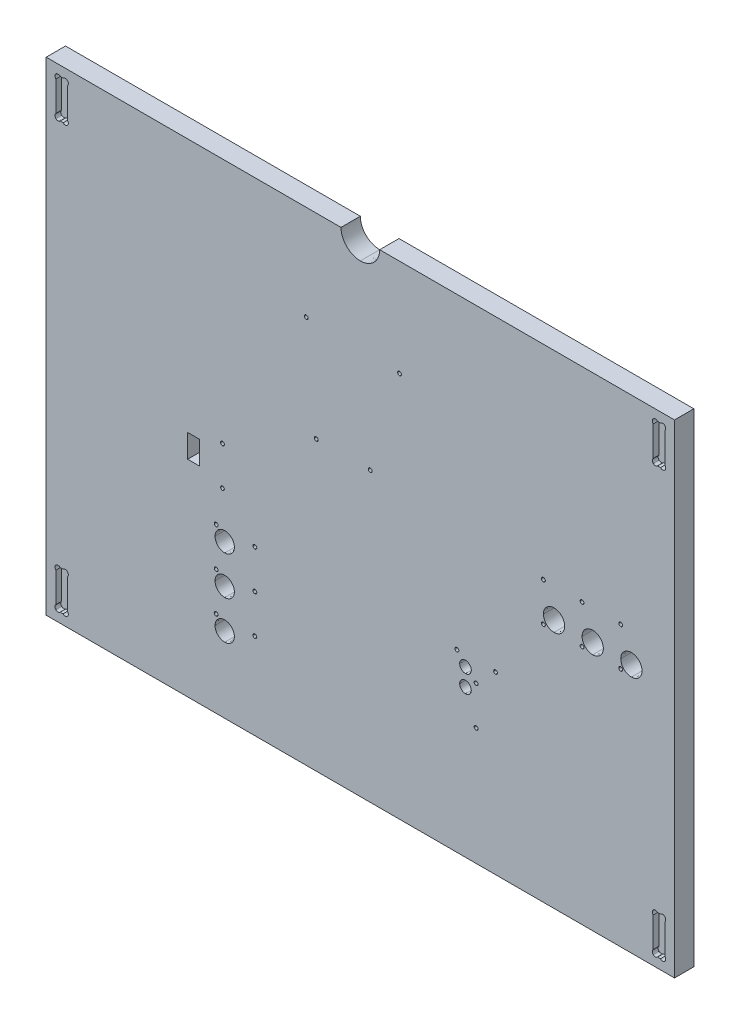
from build123d import *

# Parameters (mm, degrees)
MODEL_W                 = 5.999978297
MODEL_H                 = 12.000128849
BOSS_EXTRU_1_DEPTH      = 10
ENL_V_MAT_EXTRU_1_DEPTH = 3


with BuildPart() as part:
    # Model → Boss.-Extru.1 (new body)
    with BuildSketch(Plane.XY):
        with BuildLine():
            Line((340.358552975, 37.546028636), (187.858989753, 37.546028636))
            add(Edge.make_bspline(
                [(187.858989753, 37.546028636), (187.858989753, 32.023196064), (183.38208817, 27.545949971), (177.859255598, 27.545949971)],
                knots=[1, 1, 1, 1, 2, 2, 2, 2], degree=3))
            add(Edge.make_bspline(
                [(177.859255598, 27.545949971), (172.336423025, 27.545949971), (167.859176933, 32.023196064), (167.859176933, 37.546028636)],
                knots=[2, 2, 2, 2, 3, 3, 3, 3], degree=3))
            Line((167.859176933, 37.546028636), (15.359613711, 37.546028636))
            Line((15.359613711, 37.546028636), (15.359613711, -212.453870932))
            Line((15.359613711, -212.453870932), (340.358552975, -212.453870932))
            Line((340.358552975, -212.453870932), (340.358552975, 37.546028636))
        make_face()
        with Locations((91.548933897, -99.966249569)):
            Rectangle(MODEL_W, MODEL_H, mode=Mode.SUBTRACT)
        with BuildLine():
            add(Edge.make_bspline(
                [(112.704920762, -173.353759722), (112.704920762, -170.592515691), (110.466297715, -168.353892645), (107.704709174, -168.353892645)],
                knots=[0, 0, 0, 0, 1, 1, 1, 1], degree=3))
            add(Edge.make_bspline(
                [(107.704709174, -168.353892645), (104.943465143, -168.353892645), (102.704842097, -170.592515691), (102.704842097, -173.353759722)],
                knots=[1, 1, 1, 1, 2, 2, 2, 2], degree=3))
            add(Edge.make_bspline(
                [(102.704842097, -173.353759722), (102.704842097, -176.115348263), (104.943465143, -178.35397131), (107.704709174, -178.35397131)],
                knots=[2, 2, 2, 2, 3, 3, 3, 3], degree=3))
            add(Edge.make_bspline(
                [(107.704709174, -178.35397131), (110.466297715, -178.35397131), (112.704920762, -176.115348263), (112.704920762, -173.353759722)],
                knots=[3, 3, 3, 3, 4, 4, 4, 4], degree=3))
        make_face(mode=Mode.SUBTRACT)
        with BuildLine():
            add(Edge.make_bspline(
                [(112.704920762, -153.353946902), (112.704920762, -150.592358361), (110.466297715, -148.353735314), (107.704709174, -148.353735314)],
                knots=[0, 0, 0, 0, 1, 1, 1, 1], degree=3))
            add(Edge.make_bspline(
                [(107.704709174, -148.353735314), (104.943465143, -148.353735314), (102.704842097, -150.592358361), (102.704842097, -153.353946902)],
                knots=[1, 1, 1, 1, 2, 2, 2, 2], degree=3))
            add(Edge.make_bspline(
                [(102.704842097, -153.353946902), (102.704842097, -156.115190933), (104.943465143, -158.35381398), (107.704709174, -158.35381398)],
                knots=[2, 2, 2, 2, 3, 3, 3, 3], degree=3))
            add(Edge.make_bspline(
                [(107.704709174, -158.35381398), (110.466297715, -158.35381398), (112.704920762, -156.115190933), (112.704920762, -153.353946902)],
                knots=[3, 3, 3, 3, 4, 4, 4, 4], degree=3))
        make_face(mode=Mode.SUBTRACT)
        with BuildLine():
            add(Edge.make_bspline(
                [(112.704920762, -133.353789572), (112.704920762, -130.59254554), (110.466297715, -128.353922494), (107.704709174, -128.353922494)],
                knots=[0, 0, 0, 0, 1, 1, 1, 1], degree=3))
            add(Edge.make_bspline(
                [(107.704709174, -128.353922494), (104.943465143, -128.353922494), (102.704842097, -130.59254554), (102.704842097, -133.353789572)],
                knots=[1, 1, 1, 1, 2, 2, 2, 2], degree=3))
            add(Edge.make_bspline(
                [(102.704842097, -133.353789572), (102.704842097, -136.115378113), (104.943465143, -138.353656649), (107.704709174, -138.353656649)],
                knots=[2, 2, 2, 2, 3, 3, 3, 3], degree=3))
            add(Edge.make_bspline(
                [(107.704709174, -138.353656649), (110.466297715, -138.353656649), (112.704920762, -136.115378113), (112.704920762, -133.353789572)],
                knots=[3, 3, 3, 3, 4, 4, 4, 4], degree=3))
        make_face(mode=Mode.SUBTRACT)
        with BuildLine():
            add(Edge.make_bspline(
                [(323.558544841, -83.291556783), (323.558544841, -80.254016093), (321.095990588, -77.791634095), (318.058449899, -77.791634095)],
                knots=[0, 0, 0, 0, 1, 1, 1, 1], degree=3))
            add(Edge.make_bspline(
                [(318.058449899, -77.791634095), (315.020909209, -77.791634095), (312.558699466, -80.254016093), (312.558699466, -83.291556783)],
                knots=[1, 1, 1, 1, 2, 2, 2, 2], degree=3))
            add(Edge.make_bspline(
                [(312.558699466, -83.291556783), (312.558699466, -86.329097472), (315.020909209, -88.791996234), (318.058449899, -88.791996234)],
                knots=[2, 2, 2, 2, 3, 3, 3, 3], degree=3))
            add(Edge.make_bspline(
                [(318.058449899, -88.791996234), (321.095990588, -88.791996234), (323.558544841, -86.329097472), (323.558544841, -83.291556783)],
                knots=[3, 3, 3, 3, 4, 4, 4, 4], degree=3))
        make_face(mode=Mode.SUBTRACT)
        with BuildLine():
            add(Edge.make_bspline(
                [(303.55873202, -83.291556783), (303.55873202, -80.254016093), (301.096177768, -77.791634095), (298.058981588, -77.791634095)],
                knots=[0, 0, 0, 0, 1, 1, 1, 1], degree=3))
            add(Edge.make_bspline(
                [(298.058981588, -77.791634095), (295.021096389, -77.791634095), (292.558542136, -80.254016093), (292.558542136, -83.291556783)],
                knots=[1, 1, 1, 1, 2, 2, 2, 2], degree=3))
            add(Edge.make_bspline(
                [(292.558542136, -83.291556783), (292.558542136, -86.329097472), (295.021096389, -88.791996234), (298.058981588, -88.791996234)],
                knots=[2, 2, 2, 2, 3, 3, 3, 3], degree=3))
            add(Edge.make_bspline(
                [(298.058981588, -88.791996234), (301.096177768, -88.791996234), (303.55873202, -86.329097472), (303.55873202, -83.291556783)],
                knots=[3, 3, 3, 3, 4, 4, 4, 4], degree=3))
        make_face(mode=Mode.SUBTRACT)
        with BuildLine():
            add(Edge.make_bspline(
                [(283.5589192, -83.291556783), (283.5589192, -80.254016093), (281.096364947, -77.791634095), (278.058824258, -77.791634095)],
                knots=[0, 0, 0, 0, 1, 1, 1, 1], degree=3))
            add(Edge.make_bspline(
                [(278.058824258, -77.791634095), (275.021283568, -77.791634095), (272.559073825, -80.254016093), (272.559073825, -83.291556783)],
                knots=[1, 1, 1, 1, 2, 2, 2, 2], degree=3))
            add(Edge.make_bspline(
                [(272.559073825, -83.291556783), (272.559073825, -86.329097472), (275.021283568, -88.791996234), (278.058824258, -88.791996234)],
                knots=[2, 2, 2, 2, 3, 3, 3, 3], degree=3))
            add(Edge.make_bspline(
                [(278.058824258, -88.791996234), (281.096364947, -88.791996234), (283.5589192, -86.329097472), (283.5589192, -83.291556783)],
                knots=[3, 3, 3, 3, 4, 4, 4, 4], degree=3))
        make_face(mode=Mode.SUBTRACT)
        with BuildLine():
            add(Edge.make_bspline(
                [(235.247311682, -127.152273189), (235.247311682, -125.49552677), (233.904413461, -124.15228404), (232.247322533, -124.15228404)],
                knots=[0, 0, 0, 0, 1, 1, 1, 1], degree=3))
            add(Edge.make_bspline(
                [(232.247322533, -124.15228404), (230.590231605, -124.15228404), (229.247333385, -125.49552677), (229.247333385, -127.152273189)],
                knots=[1, 1, 1, 1, 2, 2, 2, 2], degree=3))
            add(Edge.make_bspline(
                [(229.247333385, -127.152273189), (229.247333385, -128.809364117), (230.590231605, -130.152262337), (232.247322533, -130.152262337)],
                knots=[2, 2, 2, 2, 3, 3, 3, 3], degree=3))
            add(Edge.make_bspline(
                [(232.247322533, -130.152262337), (233.904413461, -130.152262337), (235.247311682, -128.809364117), (235.247311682, -127.152273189)],
                knots=[3, 3, 3, 3, 4, 4, 4, 4], degree=3))
        make_face(mode=Mode.SUBTRACT)
        with BuildLine():
            add(Edge.make_bspline(
                [(107.560015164, -109.954012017), (107.560015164, -109.401418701), (107.112152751, -108.953900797), (106.560248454, -108.953900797)],
                knots=[0, 0, 0, 0, 1, 1, 1, 1], degree=3))
            add(Edge.make_bspline(
                [(106.560248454, -108.953900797), (106.007655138, -108.953900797), (105.560137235, -109.401418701), (105.560137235, -109.954012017)],
                knots=[1, 1, 1, 1, 2, 2, 2, 2], degree=3))
            add(Edge.make_bspline(
                [(105.560137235, -109.954012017), (105.560137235, -110.506260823), (106.007655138, -110.953778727), (106.560248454, -110.953778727)],
                knots=[2, 2, 2, 2, 3, 3, 3, 3], degree=3))
            add(Edge.make_bspline(
                [(106.560248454, -110.953778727), (107.112152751, -110.953778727), (107.560015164, -110.506260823), (107.560015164, -109.954012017)],
                knots=[3, 3, 3, 3, 4, 4, 4, 4], degree=3))
        make_face(mode=Mode.SUBTRACT)
        with BuildLine():
            add(Edge.make_bspline(
                [(107.560015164, -89.954026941), (107.560015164, -89.401778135), (107.112152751, -88.954087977), (106.560248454, -88.954087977)],
                knots=[0, 0, 0, 0, 1, 1, 1, 1], degree=3))
            add(Edge.make_bspline(
                [(106.560248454, -88.954087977), (106.007655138, -88.954087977), (105.560137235, -89.401778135), (105.560137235, -89.954026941)],
                knots=[1, 1, 1, 1, 2, 2, 2, 2], degree=3))
            add(Edge.make_bspline(
                [(105.560137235, -89.954026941), (105.560137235, -90.506275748), (106.007655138, -90.953965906), (106.560248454, -90.953965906)],
                knots=[2, 2, 2, 2, 3, 3, 3, 3], degree=3))
            add(Edge.make_bspline(
                [(106.560248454, -90.953965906), (107.112152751, -90.953965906), (107.560015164, -90.506275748), (107.560015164, -89.954026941)],
                knots=[3, 3, 3, 3, 4, 4, 4, 4], degree=3))
        make_face(mode=Mode.SUBTRACT)
        with BuildLine():
            add(Edge.make_bspline(
                [(232.245255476, -139.152918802), (233.901657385, -139.152918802), (235.245244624, -137.810020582), (235.245244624, -136.152929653)],
                knots=[0, 0, 0, 0, 1, 1, 1, 1], degree=3))
            add(Edge.make_bspline(
                [(235.245244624, -136.152929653), (235.245244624, -134.495838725), (233.901657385, -133.152940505), (232.245255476, -133.152940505)],
                knots=[1, 1, 1, 1, 2, 2, 2, 2], degree=3))
            add(Edge.make_bspline(
                [(232.245255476, -133.152940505), (230.588164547, -133.152940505), (229.245266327, -134.495838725), (229.245266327, -136.152929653)],
                knots=[2, 2, 2, 2, 3, 3, 3, 3], degree=3))
            add(Edge.make_bspline(
                [(229.245266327, -136.152929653), (229.245266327, -137.810020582), (230.588164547, -139.152918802), (232.245255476, -139.152918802)],
                knots=[3, 3, 3, 3, 4, 4, 4, 4], degree=3))
        make_face(mode=Mode.SUBTRACT)
    extrude(amount=BOSS_EXTRU_1_DEPTH)

    # Esquisse2 → Enl_v. mat.-Extru.1 (cut)
    with BuildSketch(Plane.XY.offset(10)):
        with BuildLine():
            Line((333.095602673, -207.453659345), (331.621101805, -207.453659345))
            add(Edge.make_bspline(
                [(331.621101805, -207.453659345), (330.996505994, -208.078599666), (329.983303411, -208.078599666), (329.3587076, -207.453659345)],
                knots=[1, 1, 1, 1, 2, 2, 2, 2], degree=3))
            add(Edge.make_bspline(
                [(329.3587076, -207.453659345), (328.734111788, -206.828719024), (328.734111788, -205.815860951), (329.3587076, -205.19092063)],
                knots=[2, 2, 2, 2, 3, 3, 3, 3], degree=3))
            Line((329.3587076, -205.19092063), (329.3587076, -189.716585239))
            add(Edge.make_bspline(
                [(329.3587076, -189.716585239), (328.734111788, -189.091644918), (328.734111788, -188.078442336), (329.3587076, -187.453846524)],
                knots=[4, 4, 4, 4, 5, 5, 5, 5], degree=3))
            add(Edge.make_bspline(
                [(329.3587076, -187.453846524), (329.983303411, -186.828906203), (330.996505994, -186.828906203), (331.621101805, -187.453846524)],
                knots=[5, 5, 5, 5, 6, 6, 6, 6], degree=3))
            Line((331.621101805, -187.453846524), (333.095602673, -187.453846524))
            add(Edge.make_bspline(
                [(333.095602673, -187.453846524), (333.720542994, -186.828906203), (334.733745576, -186.828906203), (335.358341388, -187.453846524)],
                knots=[7, 7, 7, 7, 8, 8, 8, 8], degree=3))
            add(Edge.make_bspline(
                [(335.358341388, -187.453846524), (335.983281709, -188.078442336), (335.983281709, -189.091644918), (335.358341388, -189.716585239)],
                knots=[8, 8, 8, 8, 9, 9, 9, 9], degree=3))
            Line((335.358341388, -189.716585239), (335.358341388, -205.19092063))
            add(Edge.make_bspline(
                [(335.358341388, -205.19092063), (335.983281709, -205.815860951), (335.983281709, -206.828719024), (335.358341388, -207.453659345)],
                knots=[10, 10, 10, 10, 11, 11, 11, 11], degree=3))
            add(Edge.make_bspline(
                [(335.358341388, -207.453659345), (334.733745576, -208.078599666), (333.720542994, -208.078599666), (333.095602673, -207.453659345)],
                knots=[11, 11, 11, 11, 12, 12, 12, 12], degree=3))
        make_face()
        with BuildLine():
            Line((22.622219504, -187.453846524), (24.096720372, -187.453846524))
            add(Edge.make_bspline(
                [(24.096720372, -187.453846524), (24.721660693, -186.828906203), (25.734863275, -186.828906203), (26.359459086, -187.453846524)],
                knots=[1, 1, 1, 1, 2, 2, 2, 2], degree=3))
            add(Edge.make_bspline(
                [(26.359459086, -187.453846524), (26.984399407, -188.078442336), (26.984399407, -189.091644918), (26.359459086, -189.716585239)],
                knots=[2, 2, 2, 2, 3, 3, 3, 3], degree=3))
            Line((26.359459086, -189.716585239), (26.359459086, -205.19092063))
            add(Edge.make_bspline(
                [(26.359459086, -205.19092063), (26.984399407, -205.815860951), (26.984399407, -206.828719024), (26.359459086, -207.453659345)],
                knots=[4, 4, 4, 4, 5, 5, 5, 5], degree=3))
            add(Edge.make_bspline(
                [(26.359459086, -207.453659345), (25.734863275, -208.078599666), (24.721660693, -208.078599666), (24.096720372, -207.453659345)],
                knots=[5, 5, 5, 5, 6, 6, 6, 6], degree=3))
            Line((24.096720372, -207.453659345), (22.622219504, -207.453659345))
            add(Edge.make_bspline(
                [(22.622219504, -207.453659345), (21.997623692, -208.078599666), (20.984076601, -208.078599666), (20.359480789, -207.453659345)],
                knots=[7, 7, 7, 7, 8, 8, 8, 8], degree=3))
            add(Edge.make_bspline(
                [(20.359480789, -207.453659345), (19.734884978, -206.828719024), (19.734884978, -205.815860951), (20.359480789, -205.19092063)],
                knots=[8, 8, 8, 8, 9, 9, 9, 9], degree=3))
            Line((20.359480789, -205.19092063), (20.359480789, -189.716585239))
            add(Edge.make_bspline(
                [(20.359480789, -189.716585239), (19.734884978, -189.091644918), (19.734884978, -188.078442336), (20.359480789, -187.453846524)],
                knots=[10, 10, 10, 10, 11, 11, 11, 11], degree=3))
            add(Edge.make_bspline(
                [(20.359480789, -187.453846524), (20.984076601, -186.828906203), (21.997623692, -186.828906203), (22.622219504, -187.453846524)],
                knots=[11, 11, 11, 11, 12, 12, 12, 12], degree=3))
        make_face()
        with BuildLine():
            Line((22.622219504, 32.545817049), (24.096720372, 32.545817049))
            add(Edge.make_bspline(
                [(24.096720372, 32.545817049), (24.721660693, 33.17075737), (25.734863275, 33.17075737), (26.359459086, 32.545817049)],
                knots=[1, 1, 1, 1, 2, 2, 2, 2], degree=3))
            add(Edge.make_bspline(
                [(26.359459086, 32.545817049), (26.984399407, 31.920876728), (26.984399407, 30.908018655), (26.359459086, 30.283078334)],
                knots=[2, 2, 2, 2, 3, 3, 3, 3], degree=3))
            Line((26.359459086, 30.283078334), (26.359459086, 14.808742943))
            add(Edge.make_bspline(
                [(26.359459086, 14.808742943), (26.984399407, 14.183802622), (26.984399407, 13.17060004), (26.359459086, 12.546004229)],
                knots=[4, 4, 4, 4, 5, 5, 5, 5], degree=3))
            add(Edge.make_bspline(
                [(26.359459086, 12.546004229), (25.734863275, 11.921063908), (24.721660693, 11.921063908), (24.096720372, 12.546004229)],
                knots=[5, 5, 5, 5, 6, 6, 6, 6], degree=3))
            Line((24.096720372, 12.546004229), (22.622219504, 12.546004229))
            add(Edge.make_bspline(
                [(22.622219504, 12.546004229), (21.997623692, 11.921063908), (20.984076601, 11.921063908), (20.359480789, 12.546004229)],
                knots=[7, 7, 7, 7, 8, 8, 8, 8], degree=3))
            add(Edge.make_bspline(
                [(20.359480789, 12.546004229), (19.734884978, 13.17060004), (19.734884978, 14.183802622), (20.359480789, 14.808742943)],
                knots=[8, 8, 8, 8, 9, 9, 9, 9], degree=3))
            Line((20.359480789, 14.808742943), (20.359480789, 30.283078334))
            add(Edge.make_bspline(
                [(20.359480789, 30.283078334), (19.734884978, 30.908018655), (19.734884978, 31.920876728), (20.359480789, 32.545817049)],
                knots=[10, 10, 10, 10, 11, 11, 11, 11], degree=3))
            add(Edge.make_bspline(
                [(20.359480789, 32.545817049), (20.984076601, 33.17075737), (21.997623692, 33.17075737), (22.622219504, 32.545817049)],
                knots=[11, 11, 11, 11, 12, 12, 12, 12], degree=3))
        make_face()
        with BuildLine():
            Line((333.095602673, 12.546004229), (331.621101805, 12.546004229))
            add(Edge.make_bspline(
                [(331.621101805, 12.546004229), (330.996505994, 11.921063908), (329.983303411, 11.921063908), (329.3587076, 12.546004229)],
                knots=[1, 1, 1, 1, 2, 2, 2, 2], degree=3))
            add(Edge.make_bspline(
                [(329.3587076, 12.546004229), (328.734111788, 13.17060004), (328.734111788, 14.183802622), (329.3587076, 14.808742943)],
                knots=[2, 2, 2, 2, 3, 3, 3, 3], degree=3))
            Line((329.3587076, 14.808742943), (329.3587076, 30.283078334))
            add(Edge.make_bspline(
                [(329.3587076, 30.283078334), (328.734111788, 30.908018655), (328.734111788, 31.920876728), (329.3587076, 32.545817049)],
                knots=[4, 4, 4, 4, 5, 5, 5, 5], degree=3))
            add(Edge.make_bspline(
                [(329.3587076, 32.545817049), (329.983303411, 33.17075737), (330.996505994, 33.17075737), (331.621101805, 32.545817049)],
                knots=[5, 5, 5, 5, 6, 6, 6, 6], degree=3))
            Line((331.621101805, 32.545817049), (333.095602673, 32.545817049))
            add(Edge.make_bspline(
                [(333.095602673, 32.545817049), (333.720542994, 33.17075737), (334.733745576, 33.17075737), (335.358341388, 32.545817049)],
                knots=[7, 7, 7, 7, 8, 8, 8, 8], degree=3))
            add(Edge.make_bspline(
                [(335.358341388, 32.545817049), (335.983281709, 31.920876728), (335.983281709, 30.908018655), (335.358341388, 30.283078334)],
                knots=[8, 8, 8, 8, 9, 9, 9, 9], degree=3))
            Line((335.358341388, 30.283078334), (335.358341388, 14.808742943))
            add(Edge.make_bspline(
                [(335.358341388, 14.808742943), (335.983281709, 14.183802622), (335.983281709, 13.17060004), (335.358341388, 12.546004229)],
                knots=[10, 10, 10, 10, 11, 11, 11, 11], degree=3))
            add(Edge.make_bspline(
                [(335.358341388, 12.546004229), (334.733745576, 11.921063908), (333.720542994, 11.921063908), (333.095602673, 12.546004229)],
                knots=[11, 11, 11, 11, 12, 12, 12, 12], degree=3))
        make_face()
        with BuildLine():
            add(Edge.make_bspline(
                [(313.558810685, -67.919885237), (313.558810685, -67.367636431), (313.110948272, -66.919774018), (312.558699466, -66.919774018)],
                knots=[0, 0, 0, 0, 1, 1, 1, 1], degree=3))
            add(Edge.make_bspline(
                [(312.558699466, -66.919774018), (312.00645066, -66.919774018), (311.558932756, -67.367636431), (311.558932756, -67.919885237)],
                knots=[1, 1, 1, 1, 2, 2, 2, 2], degree=3))
            add(Edge.make_bspline(
                [(311.558932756, -67.919885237), (311.558932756, -68.472134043), (312.00645066, -68.919824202), (312.558699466, -68.919824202)],
                knots=[2, 2, 2, 2, 3, 3, 3, 3], degree=3))
            add(Edge.make_bspline(
                [(312.558699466, -68.919824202), (313.110948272, -68.919824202), (313.558810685, -68.472134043), (313.558810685, -67.919885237)],
                knots=[3, 3, 3, 3, 4, 4, 4, 4], degree=3))
        make_face()
        with BuildLine():
            add(Edge.make_bspline(
                [(313.558810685, -87.919698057), (313.558810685, -87.367449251), (313.110948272, -86.919931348), (312.558699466, -86.919931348)],
                knots=[0, 0, 0, 0, 1, 1, 1, 1], degree=3))
            add(Edge.make_bspline(
                [(312.558699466, -86.919931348), (312.00645066, -86.919931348), (311.558932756, -87.367449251), (311.558932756, -87.919698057)],
                knots=[1, 1, 1, 1, 2, 2, 2, 2], degree=3))
            add(Edge.make_bspline(
                [(311.558932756, -87.919698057), (311.558932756, -88.472291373), (312.00645066, -88.919809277), (312.558699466, -88.919809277)],
                knots=[2, 2, 2, 2, 3, 3, 3, 3], degree=3))
            add(Edge.make_bspline(
                [(312.558699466, -88.919809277), (313.110948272, -88.919809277), (313.558810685, -88.472291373), (313.558810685, -87.919698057)],
                knots=[3, 3, 3, 3, 4, 4, 4, 4], degree=3))
        make_face()
        with BuildLine():
            add(Edge.make_bspline(
                [(293.558653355, -67.919885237), (293.558653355, -67.367636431), (293.111135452, -66.919774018), (292.558886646, -66.919774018)],
                knots=[0, 0, 0, 0, 1, 1, 1, 1], degree=3))
            add(Edge.make_bspline(
                [(292.558886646, -66.919774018), (292.006637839, -66.919774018), (291.558775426, -67.367636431), (291.558775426, -67.919885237)],
                knots=[1, 1, 1, 1, 2, 2, 2, 2], degree=3))
            add(Edge.make_bspline(
                [(291.558775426, -67.919885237), (291.558775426, -68.472134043), (292.006637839, -68.919824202), (292.558886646, -68.919824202)],
                knots=[2, 2, 2, 2, 3, 3, 3, 3], degree=3))
            add(Edge.make_bspline(
                [(292.558886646, -68.919824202), (293.111135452, -68.919824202), (293.558653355, -68.472134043), (293.558653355, -67.919885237)],
                knots=[3, 3, 3, 3, 4, 4, 4, 4], degree=3))
        make_face()
        with BuildLine():
            add(Edge.make_bspline(
                [(293.558653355, -87.919698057), (293.558653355, -87.367449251), (293.111135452, -86.919931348), (292.558886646, -86.919931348)],
                knots=[0, 0, 0, 0, 1, 1, 1, 1], degree=3))
            add(Edge.make_bspline(
                [(292.558886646, -86.919931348), (292.006637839, -86.919931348), (291.558775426, -87.367449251), (291.558775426, -87.919698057)],
                knots=[1, 1, 1, 1, 2, 2, 2, 2], degree=3))
            add(Edge.make_bspline(
                [(291.558775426, -87.919698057), (291.558775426, -88.472291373), (292.006637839, -88.919809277), (292.558886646, -88.919809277)],
                knots=[2, 2, 2, 2, 3, 3, 3, 3], degree=3))
            add(Edge.make_bspline(
                [(292.558886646, -88.919809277), (293.111135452, -88.919809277), (293.558653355, -88.472291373), (293.558653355, -87.919698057)],
                knots=[3, 3, 3, 3, 4, 4, 4, 4], degree=3))
        make_face()
        with BuildLine():
            add(Edge.make_bspline(
                [(273.558840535, -67.919885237), (273.558840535, -67.367636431), (273.110978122, -66.919774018), (272.558729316, -66.919774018)],
                knots=[0, 0, 0, 0, 1, 1, 1, 1], degree=3))
            add(Edge.make_bspline(
                [(272.558729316, -66.919774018), (272.006480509, -66.919774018), (271.558962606, -67.367636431), (271.558962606, -67.919885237)],
                knots=[1, 1, 1, 1, 2, 2, 2, 2], degree=3))
            add(Edge.make_bspline(
                [(271.558962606, -67.919885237), (271.558962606, -68.472134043), (272.006480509, -68.919824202), (272.558729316, -68.919824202)],
                knots=[2, 2, 2, 2, 3, 3, 3, 3], degree=3))
            add(Edge.make_bspline(
                [(272.558729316, -68.919824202), (273.110978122, -68.919824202), (273.558840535, -68.472134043), (273.558840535, -67.919885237)],
                knots=[3, 3, 3, 3, 4, 4, 4, 4], degree=3))
        make_face()
        with BuildLine():
            add(Edge.make_bspline(
                [(273.558840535, -87.919698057), (273.558840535, -87.367449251), (273.110978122, -86.919931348), (272.558729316, -86.919931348)],
                knots=[0, 0, 0, 0, 1, 1, 1, 1], degree=3))
            add(Edge.make_bspline(
                [(272.558729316, -86.919931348), (272.006480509, -86.919931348), (271.558962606, -87.367449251), (271.558962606, -87.919698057)],
                knots=[1, 1, 1, 1, 2, 2, 2, 2], degree=3))
            add(Edge.make_bspline(
                [(271.558962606, -87.919698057), (271.558962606, -88.472291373), (272.006480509, -88.919809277), (272.558729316, -88.919809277)],
                knots=[2, 2, 2, 2, 3, 3, 3, 3], degree=3))
            add(Edge.make_bspline(
                [(272.558729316, -88.919809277), (273.110978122, -88.919809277), (273.558840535, -88.472291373), (273.558840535, -87.919698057)],
                knots=[3, 3, 3, 3, 4, 4, 4, 4], degree=3))
        make_face()
        with BuildLine():
            add(Edge.make_bspline(
                [(124.294566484, -167.85366478), (124.294566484, -167.301415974), (123.846704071, -166.853553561), (123.294455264, -166.853553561)],
                knots=[0, 0, 0, 0, 1, 1, 1, 1], degree=3))
            add(Edge.make_bspline(
                [(123.294455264, -166.853553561), (122.742206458, -166.853553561), (122.294344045, -167.301415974), (122.294344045, -167.85366478)],
                knots=[1, 1, 1, 1, 2, 2, 2, 2], degree=3))
            add(Edge.make_bspline(
                [(122.294344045, -167.85366478), (122.294344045, -168.405913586), (122.742206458, -168.853775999), (123.294455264, -168.853775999)],
                knots=[2, 2, 2, 2, 3, 3, 3, 3], degree=3))
            add(Edge.make_bspline(
                [(123.294455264, -168.853775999), (123.846704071, -168.853775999), (124.294566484, -168.405913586), (124.294566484, -167.85366478)],
                knots=[3, 3, 3, 3, 4, 4, 4, 4], degree=3))
        make_face()
        with BuildLine():
            add(Edge.make_bspline(
                [(104.294409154, -167.85366478), (104.294409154, -167.301415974), (103.84689125, -166.853553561), (103.294642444, -166.853553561)],
                knots=[0, 0, 0, 0, 1, 1, 1, 1], degree=3))
            add(Edge.make_bspline(
                [(103.294642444, -166.853553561), (102.742049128, -166.853553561), (102.294531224, -167.301415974), (102.294531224, -167.85366478)],
                knots=[1, 1, 1, 1, 2, 2, 2, 2], degree=3))
            add(Edge.make_bspline(
                [(102.294531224, -167.85366478), (102.294531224, -168.405913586), (102.742049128, -168.853775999), (103.294642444, -168.853775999)],
                knots=[2, 2, 2, 2, 3, 3, 3, 3], degree=3))
            add(Edge.make_bspline(
                [(103.294642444, -168.853775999), (103.84689125, -168.853775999), (104.294409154, -168.405913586), (104.294409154, -167.85366478)],
                knots=[3, 3, 3, 3, 4, 4, 4, 4], degree=3))
        make_face()
        with BuildLine():
            add(Edge.make_bspline(
                [(124.294566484, -147.85385196), (124.294566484, -147.301258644), (123.846704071, -146.85374074), (123.294455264, -146.85374074)],
                knots=[0, 0, 0, 0, 1, 1, 1, 1], degree=3))
            add(Edge.make_bspline(
                [(123.294455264, -146.85374074), (122.742206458, -146.85374074), (122.294344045, -147.301258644), (122.294344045, -147.85385196)],
                knots=[1, 1, 1, 1, 2, 2, 2, 2], degree=3))
            add(Edge.make_bspline(
                [(122.294344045, -147.85385196), (122.294344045, -148.406100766), (122.742206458, -148.853618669), (123.294455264, -148.853618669)],
                knots=[2, 2, 2, 2, 3, 3, 3, 3], degree=3))
            add(Edge.make_bspline(
                [(123.294455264, -148.853618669), (123.846704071, -148.853618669), (124.294566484, -148.406100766), (124.294566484, -147.85385196)],
                knots=[3, 3, 3, 3, 4, 4, 4, 4], degree=3))
        make_face()
        with BuildLine():
            add(Edge.make_bspline(
                [(104.294409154, -147.85385196), (104.294409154, -147.301258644), (103.84689125, -146.85374074), (103.294642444, -146.85374074)],
                knots=[0, 0, 0, 0, 1, 1, 1, 1], degree=3))
            add(Edge.make_bspline(
                [(103.294642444, -146.85374074), (102.742049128, -146.85374074), (102.294531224, -147.301258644), (102.294531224, -147.85385196)],
                knots=[1, 1, 1, 1, 2, 2, 2, 2], degree=3))
            add(Edge.make_bspline(
                [(102.294531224, -147.85385196), (102.294531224, -148.406100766), (102.742049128, -148.853618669), (103.294642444, -148.853618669)],
                knots=[2, 2, 2, 2, 3, 3, 3, 3], degree=3))
            add(Edge.make_bspline(
                [(103.294642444, -148.853618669), (103.84689125, -148.853618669), (104.294409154, -148.406100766), (104.294409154, -147.85385196)],
                knots=[3, 3, 3, 3, 4, 4, 4, 4], degree=3))
        make_face()
        with BuildLine():
            add(Edge.make_bspline(
                [(124.294566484, -127.853694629), (124.294566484, -127.301445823), (123.846704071, -126.85358341), (123.294455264, -126.85358341)],
                knots=[0, 0, 0, 0, 1, 1, 1, 1], degree=3))
            add(Edge.make_bspline(
                [(123.294455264, -126.85358341), (122.742206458, -126.85358341), (122.294344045, -127.301445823), (122.294344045, -127.853694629)],
                knots=[1, 1, 1, 1, 2, 2, 2, 2], degree=3))
            add(Edge.make_bspline(
                [(122.294344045, -127.853694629), (122.294344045, -128.405943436), (122.742206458, -128.853805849), (123.294455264, -128.853805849)],
                knots=[2, 2, 2, 2, 3, 3, 3, 3], degree=3))
            add(Edge.make_bspline(
                [(123.294455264, -128.853805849), (123.846704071, -128.853805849), (124.294566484, -128.405943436), (124.294566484, -127.853694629)],
                knots=[3, 3, 3, 3, 4, 4, 4, 4], degree=3))
        make_face()
        with BuildLine():
            add(Edge.make_bspline(
                [(104.294409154, -127.853694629), (104.294409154, -127.301445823), (103.84689125, -126.85358341), (103.294642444, -126.85358341)],
                knots=[0, 0, 0, 0, 1, 1, 1, 1], degree=3))
            add(Edge.make_bspline(
                [(103.294642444, -126.85358341), (102.742049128, -126.85358341), (102.294531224, -127.301445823), (102.294531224, -127.853694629)],
                knots=[1, 1, 1, 1, 2, 2, 2, 2], degree=3))
            add(Edge.make_bspline(
                [(102.294531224, -127.853694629), (102.294531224, -128.405943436), (102.742049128, -128.853805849), (103.294642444, -128.853805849)],
                knots=[2, 2, 2, 2, 3, 3, 3, 3], degree=3))
            add(Edge.make_bspline(
                [(103.294642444, -128.853805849), (103.84689125, -128.853805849), (104.294409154, -128.405943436), (104.294409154, -127.853694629)],
                knots=[3, 3, 3, 3, 4, 4, 4, 4], degree=3))
        make_face()
        with BuildLine():
            add(Edge.make_bspline(
                [(150.859008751, -11.654069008), (150.859008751, -11.101820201), (150.411490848, -10.653957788), (149.859242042, -10.653957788)],
                knots=[0, 0, 0, 0, 1, 1, 1, 1], degree=3))
            add(Edge.make_bspline(
                [(149.859242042, -10.653957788), (149.306993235, -10.653957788), (148.859130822, -11.101820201), (148.859130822, -11.654069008)],
                knots=[1, 1, 1, 1, 2, 2, 2, 2], degree=3))
            add(Edge.make_bspline(
                [(148.859130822, -11.654069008), (148.859130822, -12.206317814), (149.306993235, -12.654180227), (149.859242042, -12.654180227)],
                knots=[2, 2, 2, 2, 3, 3, 3, 3], degree=3))
            add(Edge.make_bspline(
                [(149.859242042, -12.654180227), (150.411490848, -12.654180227), (150.859008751, -12.206317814), (150.859008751, -11.654069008)],
                knots=[3, 3, 3, 3, 4, 4, 4, 4], degree=3))
        make_face()
        with BuildLine():
            add(Edge.make_bspline(
                [(156.059035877, -63.653995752), (156.059035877, -63.101746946), (155.611517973, -62.654056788), (155.059269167, -62.654056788)],
                knots=[0, 0, 0, 0, 1, 1, 1, 1], degree=3))
            add(Edge.make_bspline(
                [(155.059269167, -62.654056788), (154.507020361, -62.654056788), (154.059157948, -63.101746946), (154.059157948, -63.653995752)],
                knots=[1, 1, 1, 1, 2, 2, 2, 2], degree=3))
            add(Edge.make_bspline(
                [(154.059157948, -63.653995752), (154.059157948, -64.206244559), (154.507020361, -64.654106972), (155.059269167, -64.654106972)],
                knots=[2, 2, 2, 2, 3, 3, 3, 3], degree=3))
            add(Edge.make_bspline(
                [(155.059269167, -64.654106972), (155.611517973, -64.654106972), (156.059035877, -64.206244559), (156.059035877, -63.653995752)],
                knots=[3, 3, 3, 3, 4, 4, 4, 4], degree=3))
        make_face()
        with BuildLine():
            add(Edge.make_bspline(
                [(199.159247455, -12.754087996), (199.159247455, -12.20183919), (198.711385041, -11.753976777), (198.159136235, -11.753976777)],
                knots=[0, 0, 0, 0, 1, 1, 1, 1], degree=3))
            add(Edge.make_bspline(
                [(198.159136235, -11.753976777), (197.606887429, -11.753976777), (197.159025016, -12.20183919), (197.159025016, -12.754087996)],
                knots=[1, 1, 1, 1, 2, 2, 2, 2], degree=3))
            add(Edge.make_bspline(
                [(197.159025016, -12.754087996), (197.159025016, -13.306336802), (197.606887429, -13.754199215), (198.159136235, -13.754199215)],
                knots=[2, 2, 2, 2, 3, 3, 3, 3], degree=3))
            add(Edge.make_bspline(
                [(198.159136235, -13.754199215), (198.711385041, -13.754199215), (199.159247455, -13.306336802), (199.159247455, -12.754087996)],
                knots=[3, 3, 3, 3, 4, 4, 4, 4], degree=3))
        make_face()
        with BuildLine():
            add(Edge.make_bspline(
                [(183.959141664, -63.653995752), (183.959141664, -63.101746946), (183.511279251, -62.654056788), (182.959030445, -62.654056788)],
                knots=[0, 0, 0, 0, 1, 1, 1, 1], degree=3))
            add(Edge.make_bspline(
                [(182.959030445, -62.654056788), (182.406781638, -62.654056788), (181.959263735, -63.101746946), (181.959263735, -63.653995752)],
                knots=[1, 1, 1, 1, 2, 2, 2, 2], degree=3))
            add(Edge.make_bspline(
                [(181.959263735, -63.653995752), (181.959263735, -64.206244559), (182.406781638, -64.654106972), (182.959030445, -64.654106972)],
                knots=[2, 2, 2, 2, 3, 3, 3, 3], degree=3))
            add(Edge.make_bspline(
                [(182.959030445, -64.654106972), (183.511279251, -64.654106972), (183.959141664, -64.206244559), (183.959141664, -63.653995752)],
                knots=[3, 3, 3, 3, 4, 4, 4, 4], degree=3))
        make_face()
        with BuildLine():
            add(Edge.make_bspline(
                [(248.82339946, -121.652867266), (248.82339946, -121.100618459), (248.375537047, -120.653100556), (247.823288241, -120.653100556)],
                knots=[0, 0, 0, 0, 1, 1, 1, 1], degree=3))
            add(Edge.make_bspline(
                [(247.823288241, -120.653100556), (247.271039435, -120.653100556), (246.823521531, -121.100618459), (246.823521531, -121.652867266)],
                knots=[1, 1, 1, 1, 2, 2, 2, 2], degree=3))
            add(Edge.make_bspline(
                [(246.823521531, -121.652867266), (246.823521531, -122.205460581), (247.271039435, -122.652978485), (247.823288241, -122.652978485)],
                knots=[2, 2, 2, 2, 3, 3, 3, 3], degree=3))
            add(Edge.make_bspline(
                [(247.823288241, -122.652978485), (248.375537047, -122.652978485), (248.82339946, -122.205460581), (248.82339946, -121.652867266)],
                knots=[3, 3, 3, 3, 4, 4, 4, 4], degree=3))
        make_face()
        with BuildLine():
            add(Edge.make_bspline(
                [(228.82324213, -121.652867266), (228.82324213, -121.100618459), (228.375724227, -120.653100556), (227.82347542, -120.653100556)],
                knots=[0, 0, 0, 0, 1, 1, 1, 1], degree=3))
            add(Edge.make_bspline(
                [(227.82347542, -120.653100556), (227.271226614, -120.653100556), (226.823364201, -121.100618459), (226.823364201, -121.652867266)],
                knots=[1, 1, 1, 1, 2, 2, 2, 2], degree=3))
            add(Edge.make_bspline(
                [(226.823364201, -121.652867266), (226.823364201, -122.205460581), (227.271226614, -122.652978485), (227.82347542, -122.652978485)],
                knots=[2, 2, 2, 2, 3, 3, 3, 3], degree=3))
            add(Edge.make_bspline(
                [(227.82347542, -122.652978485), (228.375724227, -122.652978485), (228.82324213, -122.205460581), (228.82324213, -121.652867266)],
                knots=[3, 3, 3, 3, 4, 4, 4, 4], degree=3))
        make_face()
        with BuildLine():
            add(Edge.make_bspline(
                [(237.744316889, -152.729006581), (238.296910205, -152.729006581), (238.744083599, -152.281144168), (238.744083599, -151.728895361)],
                knots=[0, 0, 0, 0, 1, 1, 1, 1], degree=3))
            add(Edge.make_bspline(
                [(238.744083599, -151.728895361), (238.744083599, -151.176646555), (238.296910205, -150.729128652), (237.744316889, -150.729128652)],
                knots=[1, 1, 1, 1, 2, 2, 2, 2], degree=3))
            add(Edge.make_bspline(
                [(237.744316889, -150.729128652), (237.191723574, -150.729128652), (236.74455018, -151.176646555), (236.74455018, -151.728895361)],
                knots=[2, 2, 2, 2, 3, 3, 3, 3], degree=3))
            add(Edge.make_bspline(
                [(236.74455018, -151.728895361), (236.74455018, -152.281144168), (237.191723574, -152.729006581), (237.744316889, -152.729006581)],
                knots=[3, 3, 3, 3, 4, 4, 4, 4], degree=3))
        make_face()
        with BuildLine():
            add(Edge.make_bspline(
                [(237.744316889, -132.728849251), (238.296910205, -132.728849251), (238.744083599, -132.281331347), (238.744083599, -131.729082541)],
                knots=[0, 0, 0, 0, 1, 1, 1, 1], degree=3))
            add(Edge.make_bspline(
                [(238.744083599, -131.729082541), (238.744083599, -131.176833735), (238.296910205, -130.728971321), (237.744316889, -130.728971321)],
                knots=[1, 1, 1, 1, 2, 2, 2, 2], degree=3))
            add(Edge.make_bspline(
                [(237.744316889, -130.728971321), (237.191723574, -130.728971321), (236.74455018, -131.176833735), (236.74455018, -131.729082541)],
                knots=[2, 2, 2, 2, 3, 3, 3, 3], degree=3))
            add(Edge.make_bspline(
                [(236.74455018, -131.729082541), (236.74455018, -132.281331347), (237.191723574, -132.728849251), (237.744316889, -132.728849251)],
                knots=[3, 3, 3, 3, 4, 4, 4, 4], degree=3))
        make_face()
    extrude(amount=-ENL_V_MAT_EXTRU_1_DEPTH, mode=Mode.SUBTRACT)


solid = part.part
